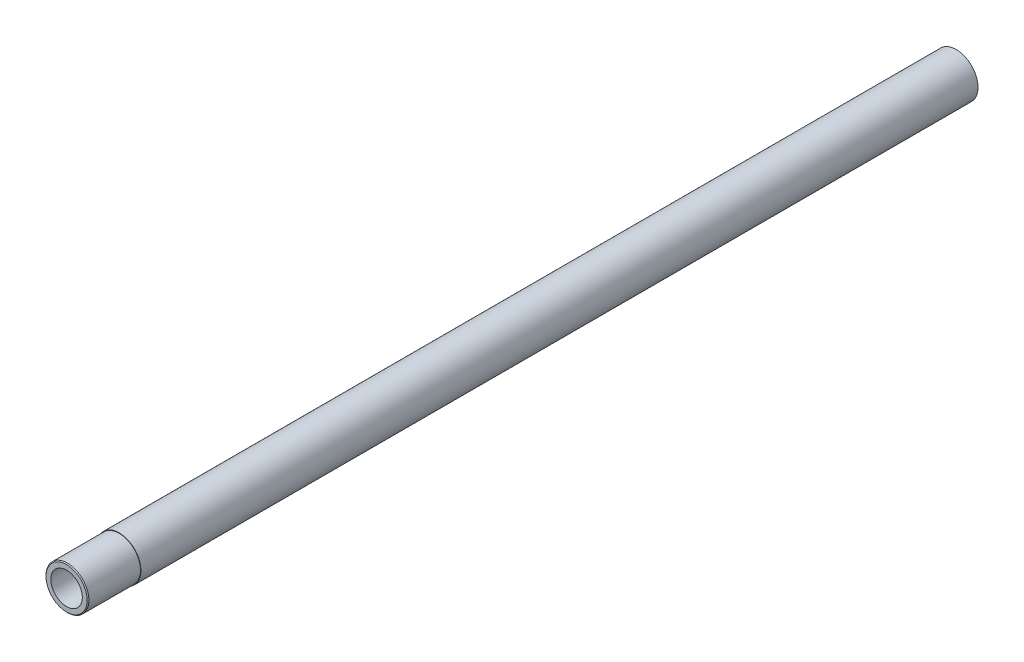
from build123d import *

# Parameters (mm, degrees)
SMUSSO1_SIZE = 0.2


with BuildPart() as part:
    # Schizzo1 → Rivoluzione1 (revolve)
    with BuildSketch(Plane.XZ, mode=Mode.PRIVATE) as rivoluzione1_sk:
        Polygon((3.6, 203.3), (3.6, 181.3), (3.5, 181.3), (3.5, 0), (5, 0), (5, 191.3), (4.9, 191.3), (4.9, 203.3), align=None)
    revolve(rivoluzione1_sk.sketch.rotate(Axis((0, 0, 290.3), (0, 0, -1)), 180), axis=Axis((0, 0, 290.3), (0, 0, -1)))

    # Smusso1
    smusso1_edges = [part.edges().sort_by_distance(p)[0] for p in [
        (4.9, 0, 203.3),
    ]]
    chamfer(smusso1_edges, length=SMUSSO1_SIZE)


solid = part.part
